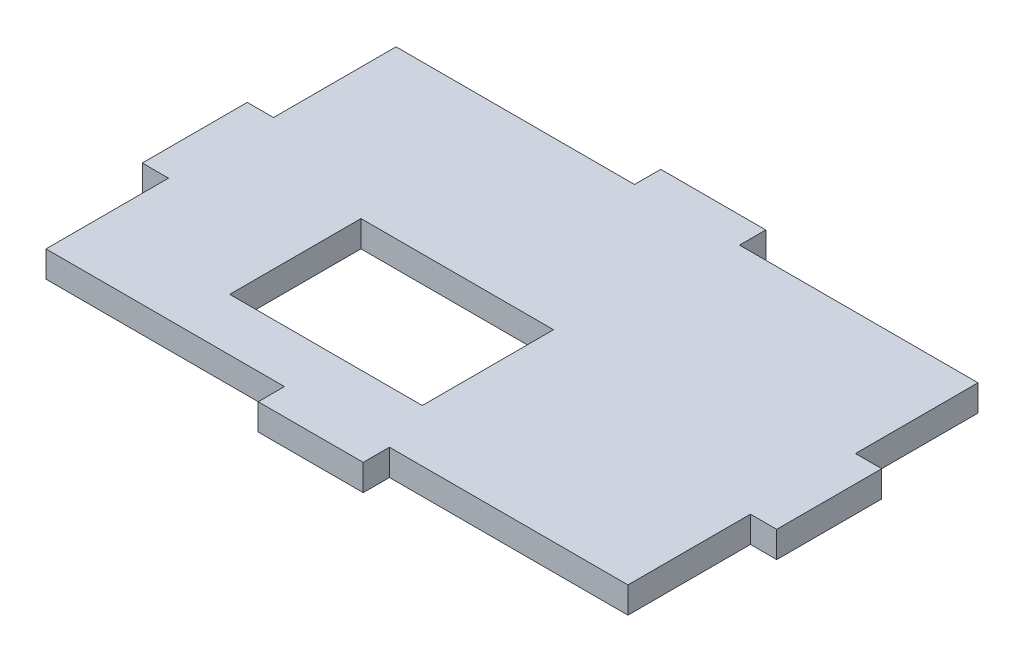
from build123d import *

# Parameters (mm, degrees)
SKETCH1_W           = 66.5
SKETCH1_H           = 40
SKETCH1_W_2         = 12
SKETCH1_H_2         = 3
SKETCH1_W_3         = 3
SKETCH1_H_3         = 12
BOSS_EXTRUDE1_DEPTH = 3
SKETCH2_W           = 22
SKETCH2_H           = 15
CUT_EXTRUDE1_DEPTH  = 3


with BuildPart() as part:
    # Sketch1 → Boss-Extrude1 (new body)
    with BuildSketch(Plane(origin=(0, 0, 0), x_dir=(1, 0, 0), z_dir=(0, 1, 0))):
        with Locations((33.25, -20)):
            Rectangle(SKETCH1_W, SKETCH1_H)
        with Locations((33.25, -41.5)):
            Rectangle(SKETCH1_W_2, SKETCH1_H_2)
        with Locations((-1.5, -20)):
            Rectangle(SKETCH1_W_3, SKETCH1_H_3)
        with Locations((33.25, 1.5)):
            Rectangle(SKETCH1_W_2, SKETCH1_H_2)
        with Locations((68, -20)):
            Rectangle(SKETCH1_W_3, SKETCH1_H_3)
    extrude(amount=BOSS_EXTRUDE1_DEPTH)

    # Sketch2 → Cut-Extrude1 (cut)
    with BuildSketch(Plane(origin=(0, 3, 0), x_dir=(1, 0, 0), z_dir=(0, 1, 0))):
        with Locations((25.995932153, -26.5)):
            Rectangle(SKETCH2_W, SKETCH2_H)
    extrude(amount=-CUT_EXTRUDE1_DEPTH, mode=Mode.SUBTRACT)


solid = part.part
